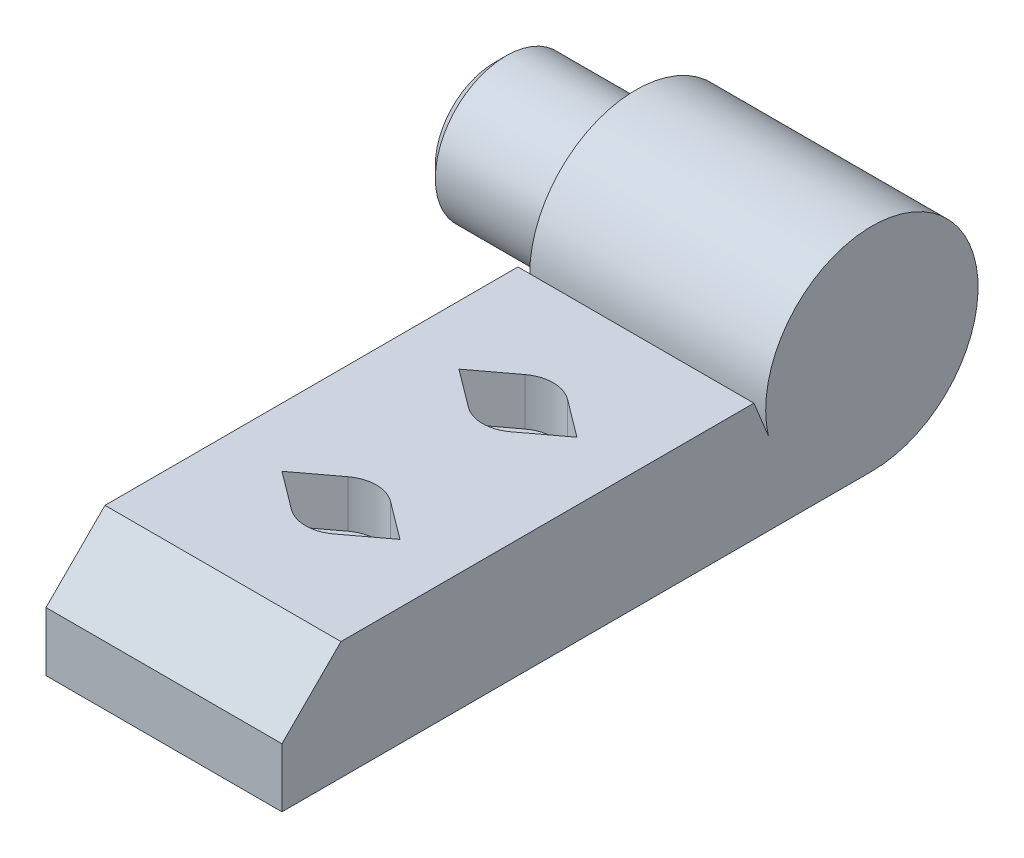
ISO-10303-21;
HEADER;
FILE_DESCRIPTION(('STEP AP214'),'2;1');
FILE_NAME('part.step','',(''),(''),'','','');
FILE_SCHEMA(('AUTOMOTIVE_DESIGN { 1 0 10303 214 1 1 1 1 }'));
ENDSEC;
DATA;
#1=APPLICATION_CONTEXT('core data for automotive mechanical design processes');
#2=APPLICATION_PROTOCOL_DEFINITION('international standard','automotive_design',2000,#1);
#3=PRODUCT_CONTEXT('',#1,'mechanical');
#4=PRODUCT('Part','Part','',(#3));
#5=PRODUCT_RELATED_PRODUCT_CATEGORY('part','',(#4));
#6=PRODUCT_DEFINITION_FORMATION('','',#4);
#7=PRODUCT_DEFINITION_CONTEXT('part definition',#1,'design');
#8=PRODUCT_DEFINITION('design','',#6,#7);
#9=PRODUCT_DEFINITION_SHAPE('','',#8);
#10=(LENGTH_UNIT() NAMED_UNIT(*) SI_UNIT(.MILLI.,.METRE.));
#11=(NAMED_UNIT(*) PLANE_ANGLE_UNIT() SI_UNIT($,.RADIAN.));
#12=(NAMED_UNIT(*) SI_UNIT($,.STERADIAN.) SOLID_ANGLE_UNIT());
#13=UNCERTAINTY_MEASURE_WITH_UNIT(LENGTH_MEASURE(1.E-05),#10,'distance_accuracy_value','');
#14=(GEOMETRIC_REPRESENTATION_CONTEXT(3) GLOBAL_UNCERTAINTY_ASSIGNED_CONTEXT((#13)) GLOBAL_UNIT_ASSIGNED_CONTEXT((#10,
#11,#12)) REPRESENTATION_CONTEXT('',''));
#15=CARTESIAN_POINT('',(0.,0.,0.));
#16=DIRECTION('',(0.,0.,1.));
#17=DIRECTION('',(1.,0.,0.));
#18=AXIS2_PLACEMENT_3D('',#15,#16,#17);
#19=CARTESIAN_POINT('',(-10.,6.,-30.));
#20=DIRECTION('',(0.,1.,0.));
#21=DIRECTION('',(0.,0.,1.));
#22=AXIS2_PLACEMENT_3D('',#19,#20,#21);
#23=CYLINDRICAL_SURFACE('',#22,3.);
#24=CARTESIAN_POINT('',(-10.,10.,-30.));
#25=DIRECTION('',(0.,1.,0.));
#26=DIRECTION('',(0.,0.,1.));
#27=AXIS2_PLACEMENT_3D('',#24,#25,#26);
#28=CIRCLE('',#27,3.);
#29=CARTESIAN_POINT('',(-8.2,10.,-32.4));
#30=VERTEX_POINT('',#29);
#31=CARTESIAN_POINT('',(-11.8,10.,-32.4));
#32=VERTEX_POINT('',#31);
#33=EDGE_CURVE('E272',#30,#32,#28,.T.);
#34=ORIENTED_EDGE('',*,*,#33,.T.);
#35=DIRECTION('',(0.,1.,0.));
#36=VECTOR('',#35,1.);
#37=CARTESIAN_POINT('',(-11.8,-5.66190378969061,-32.4));
#38=LINE('',#37,#36);
#39=CARTESIAN_POINT('',(-11.8,6.,-32.4));
#40=VERTEX_POINT('',#39);
#41=EDGE_CURVE('E182',#40,#32,#38,.T.);
#42=ORIENTED_EDGE('',*,*,#41,.F.);
#43=CARTESIAN_POINT('',(-10.,6.,-30.));
#44=DIRECTION('',(0.,1.,0.));
#45=DIRECTION('',(0.,0.,1.));
#46=AXIS2_PLACEMENT_3D('',#43,#44,#45);
#47=CIRCLE('',#46,3.);
#48=CARTESIAN_POINT('',(-8.2,6.,-32.4));
#49=VERTEX_POINT('',#48);
#50=EDGE_CURVE('E271',#49,#40,#47,.T.);
#51=ORIENTED_EDGE('',*,*,#50,.F.);
#52=DIRECTION('',(0.,1.,0.));
#53=VECTOR('',#52,1.);
#54=CARTESIAN_POINT('',(-8.2,-5.66190378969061,-32.4));
#55=LINE('',#54,#53);
#56=EDGE_CURVE('E65',#49,#30,#55,.T.);
#57=ORIENTED_EDGE('',*,*,#56,.T.);
#58=EDGE_LOOP('',(#34,#42,#51,#57));
#59=FACE_BOUND('',#58,.T.);
#60=ADVANCED_FACE('F41',(#59),#23,.F.);
#61=CARTESIAN_POINT('',(-10.,6.,-15.));
#62=DIRECTION('',(0.,1.,0.));
#63=DIRECTION('',(0.,0.,1.));
#64=AXIS2_PLACEMENT_3D('',#61,#62,#63);
#65=CYLINDRICAL_SURFACE('',#64,3.);
#66=CARTESIAN_POINT('',(-10.,10.,-15.));
#67=DIRECTION('',(0.,1.,0.));
#68=DIRECTION('',(0.,0.,1.));
#69=AXIS2_PLACEMENT_3D('',#66,#67,#68);
#70=CIRCLE('',#69,3.);
#71=CARTESIAN_POINT('',(-8.2,10.,-17.4));
#72=VERTEX_POINT('',#71);
#73=CARTESIAN_POINT('',(-11.8,10.,-17.4));
#74=VERTEX_POINT('',#73);
#75=EDGE_CURVE('E280',#72,#74,#70,.T.);
#76=ORIENTED_EDGE('',*,*,#75,.T.);
#77=DIRECTION('',(0.,1.,0.));
#78=VECTOR('',#77,1.);
#79=CARTESIAN_POINT('',(-11.8,-5.66190378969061,-17.4));
#80=LINE('',#79,#78);
#81=CARTESIAN_POINT('',(-11.8,6.,-17.4));
#82=VERTEX_POINT('',#81);
#83=EDGE_CURVE('E227',#82,#74,#80,.T.);
#84=ORIENTED_EDGE('',*,*,#83,.F.);
#85=CARTESIAN_POINT('',(-10.,6.,-15.));
#86=DIRECTION('',(0.,1.,0.));
#87=DIRECTION('',(0.,0.,1.));
#88=AXIS2_PLACEMENT_3D('',#85,#86,#87);
#89=CIRCLE('',#88,3.);
#90=CARTESIAN_POINT('',(-8.2,6.,-17.4));
#91=VERTEX_POINT('',#90);
#92=EDGE_CURVE('E275',#91,#82,#89,.T.);
#93=ORIENTED_EDGE('',*,*,#92,.F.);
#94=DIRECTION('',(0.,1.,0.));
#95=VECTOR('',#94,1.);
#96=CARTESIAN_POINT('',(-8.2,-5.66190378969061,-17.4));
#97=LINE('',#96,#95);
#98=EDGE_CURVE('E250',#91,#72,#97,.T.);
#99=ORIENTED_EDGE('',*,*,#98,.T.);
#100=EDGE_LOOP('',(#76,#84,#93,#99));
#101=FACE_BOUND('',#100,.T.);
#102=ADVANCED_FACE('F389',(#101),#65,.F.);
#103=CARTESIAN_POINT('',(-10.,-0.000999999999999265,-15.));
#104=DIRECTION('',(0.,1.,0.));
#105=DIRECTION('',(0.,0.,1.));
#106=AXIS2_PLACEMENT_3D('',#103,#104,#105);
#107=CYLINDRICAL_SURFACE('',#106,1.75);
#108=CARTESIAN_POINT('',(-10.,0.,-15.));
#109=DIRECTION('',(0.,-1.,0.));
#110=DIRECTION('',(0.,0.,-1.));
#111=AXIS2_PLACEMENT_3D('',#108,#109,#110);
#112=CIRCLE('',#111,1.75);
#113=CARTESIAN_POINT('',(-10.,0.,-16.75));
#114=VERTEX_POINT('',#113);
#115=EDGE_CURVE('E289',#114,#114,#112,.F.);
#116=ORIENTED_EDGE('',*,*,#115,.F.);
#117=EDGE_LOOP('',(#116));
#118=FACE_BOUND('',#117,.T.);
#119=CARTESIAN_POINT('',(-10.,6.,-15.));
#120=DIRECTION('',(0.,1.,0.));
#121=DIRECTION('',(0.,0.,1.));
#122=AXIS2_PLACEMENT_3D('',#119,#120,#121);
#123=CIRCLE('',#122,1.75);
#124=CARTESIAN_POINT('',(-10.,6.,-13.25));
#125=VERTEX_POINT('',#124);
#126=EDGE_CURVE('E293',#125,#125,#123,.F.);
#127=ORIENTED_EDGE('',*,*,#126,.F.);
#128=EDGE_LOOP('',(#127));
#129=FACE_BOUND('',#128,.T.);
#130=ADVANCED_FACE('F396',(#118,#129),#107,.F.);
#131=CARTESIAN_POINT('',(-10.,-0.000999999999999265,-30.));
#132=DIRECTION('',(0.,1.,0.));
#133=DIRECTION('',(0.,0.,1.));
#134=AXIS2_PLACEMENT_3D('',#131,#132,#133);
#135=CYLINDRICAL_SURFACE('',#134,1.75);
#136=CARTESIAN_POINT('',(-10.,0.,-30.));
#137=DIRECTION('',(0.,-1.,0.));
#138=DIRECTION('',(0.,0.,-1.));
#139=AXIS2_PLACEMENT_3D('',#136,#137,#138);
#140=CIRCLE('',#139,1.75);
#141=CARTESIAN_POINT('',(-10.,0.,-31.75));
#142=VERTEX_POINT('',#141);
#143=EDGE_CURVE('E284',#142,#142,#140,.F.);
#144=ORIENTED_EDGE('',*,*,#143,.F.);
#145=EDGE_LOOP('',(#144));
#146=FACE_BOUND('',#145,.T.);
#147=CARTESIAN_POINT('',(-10.,6.,-30.));
#148=DIRECTION('',(0.,1.,0.));
#149=DIRECTION('',(0.,0.,1.));
#150=AXIS2_PLACEMENT_3D('',#147,#148,#149);
#151=CIRCLE('',#150,1.75);
#152=CARTESIAN_POINT('',(-10.,6.,-28.25));
#153=VERTEX_POINT('',#152);
#154=EDGE_CURVE('E360',#153,#153,#151,.F.);
#155=ORIENTED_EDGE('',*,*,#154,.F.);
#156=EDGE_LOOP('',(#155));
#157=FACE_BOUND('',#156,.T.);
#158=ADVANCED_FACE('F520',(#146,#157),#135,.F.);
#159=CARTESIAN_POINT('',(-20.,5.,0.));
#160=DIRECTION('',(0.,0.,1.));
#161=DIRECTION('',(1.,0.,0.));
#162=AXIS2_PLACEMENT_3D('',#159,#160,#161);
#163=PLANE('',#162);
#164=DIRECTION('',(0.,-1.,0.));
#165=VECTOR('',#164,1.);
#166=CARTESIAN_POINT('',(0.,5.,0.));
#167=LINE('',#166,#165);
#168=CARTESIAN_POINT('',(0.,5.,0.));
#169=VERTEX_POINT('',#168);
#170=CARTESIAN_POINT('',(0.,0.,0.));
#171=VERTEX_POINT('',#170);
#172=EDGE_CURVE('E288',#169,#171,#167,.T.);
#173=ORIENTED_EDGE('',*,*,#172,.F.);
#174=DIRECTION('',(1.,0.,0.));
#175=VECTOR('',#174,1.);
#176=CARTESIAN_POINT('',(-20.,5.,0.));
#177=LINE('',#176,#175);
#178=CARTESIAN_POINT('',(-20.,5.,0.));
#179=VERTEX_POINT('',#178);
#180=EDGE_CURVE('E342',#179,#169,#177,.T.);
#181=ORIENTED_EDGE('',*,*,#180,.F.);
#182=DIRECTION('',(0.,-1.,0.));
#183=VECTOR('',#182,1.);
#184=CARTESIAN_POINT('',(-20.,5.,0.));
#185=LINE('',#184,#183);
#186=CARTESIAN_POINT('',(-20.,0.,0.));
#187=VERTEX_POINT('',#186);
#188=EDGE_CURVE('E294',#179,#187,#185,.T.);
#189=ORIENTED_EDGE('',*,*,#188,.T.);
#190=DIRECTION('',(1.,0.,0.));
#191=VECTOR('',#190,1.);
#192=CARTESIAN_POINT('',(-20.,0.,0.));
#193=LINE('',#192,#191);
#194=EDGE_CURVE('E319',#187,#171,#193,.T.);
#195=ORIENTED_EDGE('',*,*,#194,.T.);
#196=EDGE_LOOP('',(#173,#181,#189,#195));
#197=FACE_BOUND('',#196,.T.);
#198=ADVANCED_FACE('F501',(#197),#163,.T.);
#199=CARTESIAN_POINT('',(-20.,5.,0.));
#200=DIRECTION('',(0.,0.707106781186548,0.707106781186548));
#201=DIRECTION('',(0.,-0.707106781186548,0.707106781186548));
#202=AXIS2_PLACEMENT_3D('',#199,#200,#201);
#203=PLANE('',#202);
#204=DIRECTION('',(0.,-0.707106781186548,0.707106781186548));
#205=VECTOR('',#204,1.);
#206=CARTESIAN_POINT('',(0.,5.,0.));
#207=LINE('',#206,#205);
#208=CARTESIAN_POINT('',(0.,10.,-5.));
#209=VERTEX_POINT('',#208);
#210=EDGE_CURVE('E299',#209,#169,#207,.T.);
#211=ORIENTED_EDGE('',*,*,#210,.F.);
#212=DIRECTION('',(1.,0.,0.));
#213=VECTOR('',#212,1.);
#214=CARTESIAN_POINT('',(-20.,10.,-5.));
#215=LINE('',#214,#213);
#216=CARTESIAN_POINT('',(-20.,10.,-5.));
#217=VERTEX_POINT('',#216);
#218=EDGE_CURVE('E346',#217,#209,#215,.T.);
#219=ORIENTED_EDGE('',*,*,#218,.F.);
#220=DIRECTION('',(0.,-0.707106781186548,0.707106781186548));
#221=VECTOR('',#220,1.);
#222=CARTESIAN_POINT('',(-20.,5.,0.));
#223=LINE('',#222,#221);
#224=EDGE_CURVE('E315',#217,#179,#223,.T.);
#225=ORIENTED_EDGE('',*,*,#224,.T.);
#226=ORIENTED_EDGE('',*,*,#180,.T.);
#227=EDGE_LOOP('',(#211,#219,#225,#226));
#228=FACE_BOUND('',#227,.T.);
#229=ADVANCED_FACE('F489',(#228),#203,.T.);
#230=CARTESIAN_POINT('',(-20.,10.,-40.));
#231=DIRECTION('',(0.,1.,0.));
#232=DIRECTION('',(0.,0.,1.));
#233=AXIS2_PLACEMENT_3D('',#230,#231,#232);
#234=PLANE('',#233);
#235=DIRECTION('',(-0.8,0.,-0.6));
#236=VECTOR('',#235,1.);
#237=CARTESIAN_POINT('',(-5.,10.,-30.));
#238=LINE('',#237,#236);
#239=CARTESIAN_POINT('',(-5.,10.,-30.));
#240=VERTEX_POINT('',#239);
#241=EDGE_CURVE('E176',#240,#30,#238,.T.);
#242=ORIENTED_EDGE('',*,*,#241,.F.);
#243=DIRECTION('',(0.8,0.,-0.6));
#244=VECTOR('',#243,1.);
#245=CARTESIAN_POINT('',(-5.,10.,-30.));
#246=LINE('',#245,#244);
#247=CARTESIAN_POINT('',(-8.2,10.,-27.6));
#248=VERTEX_POINT('',#247);
#249=EDGE_CURVE('E197',#248,#240,#246,.T.);
#250=ORIENTED_EDGE('',*,*,#249,.F.);
#251=CARTESIAN_POINT('',(-11.8,10.,-27.6));
#252=VERTEX_POINT('',#251);
#253=EDGE_CURVE('E195',#252,#248,#28,.T.);
#254=ORIENTED_EDGE('',*,*,#253,.F.);
#255=DIRECTION('',(0.8,0.,0.6));
#256=VECTOR('',#255,1.);
#257=CARTESIAN_POINT('',(-15.,10.,-30.));
#258=LINE('',#257,#256);
#259=CARTESIAN_POINT('',(-15.,10.,-30.));
#260=VERTEX_POINT('',#259);
#261=EDGE_CURVE('E171',#260,#252,#258,.T.);
#262=ORIENTED_EDGE('',*,*,#261,.F.);
#263=DIRECTION('',(-0.8,0.,0.6));
#264=VECTOR('',#263,1.);
#265=CARTESIAN_POINT('',(-15.,10.,-30.));
#266=LINE('',#265,#264);
#267=EDGE_CURVE('E179',#32,#260,#266,.T.);
#268=ORIENTED_EDGE('',*,*,#267,.F.);
#269=ORIENTED_EDGE('',*,*,#33,.F.);
#270=EDGE_LOOP('',(#242,#250,#254,#262,#268,#269));
#271=FACE_BOUND('',#270,.T.);
#272=DIRECTION('',(-0.8,0.,-0.6));
#273=VECTOR('',#272,1.);
#274=CARTESIAN_POINT('',(-5.,10.,-15.));
#275=LINE('',#274,#273);
#276=CARTESIAN_POINT('',(-5.,10.,-15.));
#277=VERTEX_POINT('',#276);
#278=EDGE_CURVE('E244',#277,#72,#275,.T.);
#279=ORIENTED_EDGE('',*,*,#278,.F.);
#280=DIRECTION('',(0.8,0.,-0.6));
#281=VECTOR('',#280,1.);
#282=CARTESIAN_POINT('',(-5.,10.,-15.));
#283=LINE('',#282,#281);
#284=CARTESIAN_POINT('',(-8.2,10.,-12.6));
#285=VERTEX_POINT('',#284);
#286=EDGE_CURVE('E240',#285,#277,#283,.T.);
#287=ORIENTED_EDGE('',*,*,#286,.F.);
#288=CARTESIAN_POINT('',(-11.8,10.,-12.6));
#289=VERTEX_POINT('',#288);
#290=EDGE_CURVE('E221',#289,#285,#70,.T.);
#291=ORIENTED_EDGE('',*,*,#290,.F.);
#292=DIRECTION('',(0.8,0.,0.6));
#293=VECTOR('',#292,1.);
#294=CARTESIAN_POINT('',(-15.,10.,-15.));
#295=LINE('',#294,#293);
#296=CARTESIAN_POINT('',(-15.,10.,-15.));
#297=VERTEX_POINT('',#296);
#298=EDGE_CURVE('E237',#297,#289,#295,.T.);
#299=ORIENTED_EDGE('',*,*,#298,.F.);
#300=DIRECTION('',(-0.8,0.,0.6));
#301=VECTOR('',#300,1.);
#302=CARTESIAN_POINT('',(-15.,10.,-15.));
#303=LINE('',#302,#301);
#304=EDGE_CURVE('E233',#74,#297,#303,.T.);
#305=ORIENTED_EDGE('',*,*,#304,.F.);
#306=ORIENTED_EDGE('',*,*,#75,.F.);
#307=EDGE_LOOP('',(#279,#287,#291,#299,#305,#306));
#308=FACE_BOUND('',#307,.T.);
#309=DIRECTION('',(0.,0.,1.));
#310=VECTOR('',#309,1.);
#311=CARTESIAN_POINT('',(0.,10.,-40.));
#312=LINE('',#311,#310);
#313=CARTESIAN_POINT('',(0.,10.,-40.));
#314=VERTEX_POINT('',#313);
#315=EDGE_CURVE('E335',#314,#209,#312,.T.);
#316=ORIENTED_EDGE('',*,*,#315,.F.);
#317=DIRECTION('',(1.,0.,0.));
#318=VECTOR('',#317,1.);
#319=CARTESIAN_POINT('',(-20.,10.,-40.));
#320=LINE('',#319,#318);
#321=CARTESIAN_POINT('',(-20.,10.,-40.));
#322=VERTEX_POINT('',#321);
#323=EDGE_CURVE('E349',#322,#314,#320,.T.);
#324=ORIENTED_EDGE('',*,*,#323,.F.);
#325=DIRECTION('',(0.,0.,1.));
#326=VECTOR('',#325,1.);
#327=CARTESIAN_POINT('',(-20.,10.,-40.));
#328=LINE('',#327,#326);
#329=EDGE_CURVE('E311',#322,#217,#328,.T.);
#330=ORIENTED_EDGE('',*,*,#329,.T.);
#331=ORIENTED_EDGE('',*,*,#218,.T.);
#332=EDGE_LOOP('',(#316,#324,#330,#331));
#333=FACE_BOUND('',#332,.T.);
#334=ADVANCED_FACE('F191',(#271,#308,#333),#234,.T.);
#335=CARTESIAN_POINT('',(-20.,10.,-40.));
#336=DIRECTION('',(0.,0.378041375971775,-0.925788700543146));
#337=DIRECTION('',(0.,0.925788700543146,0.378041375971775));
#338=AXIS2_PLACEMENT_3D('',#335,#336,#337);
#339=PLANE('',#338);
#340=DIRECTION('',(0.,0.925788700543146,0.378041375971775));
#341=VECTOR('',#340,1.);
#342=CARTESIAN_POINT('',(0.,10.,-40.));
#343=LINE('',#342,#341);
#344=CARTESIAN_POINT('',(0.,7.00000000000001,-41.2250356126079));
#345=VERTEX_POINT('',#344);
#346=EDGE_CURVE('E331',#345,#314,#343,.T.);
#347=ORIENTED_EDGE('',*,*,#346,.F.);
#348=DIRECTION('',(1.,0.,0.));
#349=VECTOR('',#348,1.);
#350=CARTESIAN_POINT('',(-20.,7.00000000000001,-41.2250356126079));
#351=LINE('',#350,#349);
#352=CARTESIAN_POINT('',(-20.,7.00000000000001,-41.2250356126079));
#353=VERTEX_POINT('',#352);
#354=EDGE_CURVE('E352',#353,#345,#351,.T.);
#355=ORIENTED_EDGE('',*,*,#354,.F.);
#356=DIRECTION('',(0.,0.925788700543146,0.378041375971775));
#357=VECTOR('',#356,1.);
#358=CARTESIAN_POINT('',(-20.,10.,-40.));
#359=LINE('',#358,#357);
#360=EDGE_CURVE('E307',#353,#322,#359,.T.);
#361=ORIENTED_EDGE('',*,*,#360,.T.);
#362=ORIENTED_EDGE('',*,*,#323,.T.);
#363=EDGE_LOOP('',(#347,#355,#361,#362));
#364=FACE_BOUND('',#363,.T.);
#365=ADVANCED_FACE('F495',(#364),#339,.T.);
#366=CARTESIAN_POINT('',(-20.,9.,-50.));
#367=DIRECTION('',(1.,0.,0.));
#368=DIRECTION('',(0.,0.,-1.));
#369=AXIS2_PLACEMENT_3D('',#366,#367,#368);
#370=CYLINDRICAL_SURFACE('',#369,9.);
#371=CARTESIAN_POINT('',(0.,9.,-50.));
#372=DIRECTION('',(1.,0.,0.));
#373=DIRECTION('',(0.,0.,-1.));
#374=AXIS2_PLACEMENT_3D('',#371,#372,#373);
#375=CIRCLE('',#374,9.);
#376=CARTESIAN_POINT('',(0.,0.,-50.));
#377=VERTEX_POINT('',#376);
#378=EDGE_CURVE('E327',#377,#345,#375,.T.);
#379=ORIENTED_EDGE('',*,*,#378,.F.);
#380=DIRECTION('',(1.,0.,0.));
#381=VECTOR('',#380,1.);
#382=CARTESIAN_POINT('',(-20.,0.,-50.));
#383=LINE('',#382,#381);
#384=CARTESIAN_POINT('',(-20.,0.,-50.));
#385=VERTEX_POINT('',#384);
#386=EDGE_CURVE('E355',#385,#377,#383,.T.);
#387=ORIENTED_EDGE('',*,*,#386,.F.);
#388=CARTESIAN_POINT('',(-20.,9.,-50.));
#389=DIRECTION('',(1.,0.,0.));
#390=DIRECTION('',(0.,0.,-1.));
#391=AXIS2_PLACEMENT_3D('',#388,#389,#390);
#392=CIRCLE('',#391,9.);
#393=EDGE_CURVE('E303',#385,#353,#392,.T.);
#394=ORIENTED_EDGE('',*,*,#393,.T.);
#395=ORIENTED_EDGE('',*,*,#354,.T.);
#396=EDGE_LOOP('',(#379,#387,#394,#395));
#397=FACE_BOUND('',#396,.T.);
#398=ADVANCED_FACE('F498',(#397),#370,.T.);
#399=CARTESIAN_POINT('',(-20.,0.,0.));
#400=DIRECTION('',(0.,-1.,0.));
#401=DIRECTION('',(0.,0.,-1.));
#402=AXIS2_PLACEMENT_3D('',#399,#400,#401);
#403=PLANE('',#402);
#404=ORIENTED_EDGE('',*,*,#143,.T.);
#405=EDGE_LOOP('',(#404));
#406=FACE_BOUND('',#405,.T.);
#407=ORIENTED_EDGE('',*,*,#115,.T.);
#408=EDGE_LOOP('',(#407));
#409=FACE_BOUND('',#408,.T.);
#410=DIRECTION('',(0.,0.,-1.));
#411=VECTOR('',#410,1.);
#412=CARTESIAN_POINT('',(0.,0.,0.));
#413=LINE('',#412,#411);
#414=EDGE_CURVE('E323',#171,#377,#413,.T.);
#415=ORIENTED_EDGE('',*,*,#414,.F.);
#416=ORIENTED_EDGE('',*,*,#194,.F.);
#417=DIRECTION('',(0.,0.,-1.));
#418=VECTOR('',#417,1.);
#419=CARTESIAN_POINT('',(-20.,0.,0.));
#420=LINE('',#419,#418);
#421=EDGE_CURVE('E298',#187,#385,#420,.T.);
#422=ORIENTED_EDGE('',*,*,#421,.T.);
#423=ORIENTED_EDGE('',*,*,#386,.T.);
#424=EDGE_LOOP('',(#415,#416,#422,#423));
#425=FACE_BOUND('',#424,.T.);
#426=ADVANCED_FACE('F479',(#406,#409,#425),#403,.T.);
#427=CARTESIAN_POINT('',(-20.,9.,-50.));
#428=DIRECTION('',(1.,0.,0.));
#429=DIRECTION('',(0.,0.,-1.));
#430=AXIS2_PLACEMENT_3D('',#427,#428,#429);
#431=PLANE('',#430);
#432=CARTESIAN_POINT('',(-20.,9.,-50.));
#433=DIRECTION('',(1.,0.,0.));
#434=DIRECTION('',(0.,0.,-1.));
#435=AXIS2_PLACEMENT_3D('',#432,#433,#434);
#436=CIRCLE('',#435,6.);
#437=CARTESIAN_POINT('',(-20.,9.,-56.));
#438=VERTEX_POINT('',#437);
#439=EDGE_CURVE('E345',#438,#438,#436,.F.);
#440=ORIENTED_EDGE('',*,*,#439,.F.);
#441=EDGE_LOOP('',(#440));
#442=FACE_BOUND('',#441,.T.);
#443=ORIENTED_EDGE('',*,*,#188,.F.);
#444=ORIENTED_EDGE('',*,*,#224,.F.);
#445=ORIENTED_EDGE('',*,*,#329,.F.);
#446=ORIENTED_EDGE('',*,*,#360,.F.);
#447=ORIENTED_EDGE('',*,*,#393,.F.);
#448=ORIENTED_EDGE('',*,*,#421,.F.);
#449=EDGE_LOOP('',(#443,#444,#445,#446,#447,#448));
#450=FACE_BOUND('',#449,.T.);
#451=ADVANCED_FACE('F476',(#442,#450),#431,.F.);
#452=CARTESIAN_POINT('',(0.,9.,-50.));
#453=DIRECTION('',(1.,0.,0.));
#454=DIRECTION('',(0.,0.,-1.));
#455=AXIS2_PLACEMENT_3D('',#452,#453,#454);
#456=PLANE('',#455);
#457=ORIENTED_EDGE('',*,*,#172,.T.);
#458=ORIENTED_EDGE('',*,*,#414,.T.);
#459=ORIENTED_EDGE('',*,*,#378,.T.);
#460=ORIENTED_EDGE('',*,*,#346,.T.);
#461=ORIENTED_EDGE('',*,*,#315,.T.);
#462=ORIENTED_EDGE('',*,*,#210,.T.);
#463=EDGE_LOOP('',(#457,#458,#459,#460,#461,#462));
#464=FACE_BOUND('',#463,.T.);
#465=ADVANCED_FACE('F411',(#464),#456,.T.);
#466=CARTESIAN_POINT('',(-10.,6.,-30.));
#467=DIRECTION('',(0.,1.,0.));
#468=DIRECTION('',(0.,0.,1.));
#469=AXIS2_PLACEMENT_3D('',#466,#467,#468);
#470=PLANE('',#469);
#471=CARTESIAN_POINT('',(-11.8,6.,-27.6));
#472=VERTEX_POINT('',#471);
#473=CARTESIAN_POINT('',(-8.2,6.,-27.6));
#474=VERTEX_POINT('',#473);
#475=EDGE_CURVE('E268',#472,#474,#47,.T.);
#476=ORIENTED_EDGE('',*,*,#475,.T.);
#477=DIRECTION('',(-0.8,0.,0.6));
#478=VECTOR('',#477,1.);
#479=CARTESIAN_POINT('',(-5.,6.,-30.));
#480=LINE('',#479,#478);
#481=CARTESIAN_POINT('',(-5.,6.,-30.));
#482=VERTEX_POINT('',#481);
#483=EDGE_CURVE('E208',#482,#474,#480,.T.);
#484=ORIENTED_EDGE('',*,*,#483,.F.);
#485=DIRECTION('',(0.8,0.,0.6));
#486=VECTOR('',#485,1.);
#487=CARTESIAN_POINT('',(-5.,6.,-30.));
#488=LINE('',#487,#486);
#489=EDGE_CURVE('E418',#49,#482,#488,.T.);
#490=ORIENTED_EDGE('',*,*,#489,.F.);
#491=ORIENTED_EDGE('',*,*,#50,.T.);
#492=DIRECTION('',(0.8,0.,-0.6));
#493=VECTOR('',#492,1.);
#494=CARTESIAN_POINT('',(-15.,6.,-30.));
#495=LINE('',#494,#493);
#496=CARTESIAN_POINT('',(-15.,6.,-30.));
#497=VERTEX_POINT('',#496);
#498=EDGE_CURVE('E222',#497,#40,#495,.T.);
#499=ORIENTED_EDGE('',*,*,#498,.F.);
#500=DIRECTION('',(-0.8,0.,-0.6));
#501=VECTOR('',#500,1.);
#502=CARTESIAN_POINT('',(-15.,6.,-30.));
#503=LINE('',#502,#501);
#504=EDGE_CURVE('E57',#472,#497,#503,.T.);
#505=ORIENTED_EDGE('',*,*,#504,.F.);
#506=EDGE_LOOP('',(#476,#484,#490,#491,#499,#505));
#507=FACE_BOUND('',#506,.T.);
#508=ORIENTED_EDGE('',*,*,#154,.T.);
#509=EDGE_LOOP('',(#508));
#510=FACE_BOUND('',#509,.T.);
#511=ADVANCED_FACE('F404',(#507,#510),#470,.T.);
#512=ORIENTED_EDGE('',*,*,#253,.T.);
#513=DIRECTION('',(0.,1.,0.));
#514=VECTOR('',#513,1.);
#515=CARTESIAN_POINT('',(-8.2,-5.66190378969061,-27.6));
#516=LINE('',#515,#514);
#517=EDGE_CURVE('E214',#474,#248,#516,.T.);
#518=ORIENTED_EDGE('',*,*,#517,.F.);
#519=ORIENTED_EDGE('',*,*,#475,.F.);
#520=DIRECTION('',(0.,1.,0.));
#521=VECTOR('',#520,1.);
#522=CARTESIAN_POINT('',(-11.8,-5.66190378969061,-27.6));
#523=LINE('',#522,#521);
#524=EDGE_CURVE('E175',#472,#252,#523,.T.);
#525=ORIENTED_EDGE('',*,*,#524,.T.);
#526=EDGE_LOOP('',(#512,#518,#519,#525));
#527=FACE_BOUND('',#526,.T.);
#528=ADVANCED_FACE('F392',(#527),#23,.F.);
#529=CARTESIAN_POINT('',(-10.,6.,-15.));
#530=DIRECTION('',(0.,1.,0.));
#531=DIRECTION('',(0.,0.,1.));
#532=AXIS2_PLACEMENT_3D('',#529,#530,#531);
#533=PLANE('',#532);
#534=CARTESIAN_POINT('',(-11.8,6.,-12.6));
#535=VERTEX_POINT('',#534);
#536=CARTESIAN_POINT('',(-8.2,6.,-12.6));
#537=VERTEX_POINT('',#536);
#538=EDGE_CURVE('E276',#535,#537,#89,.T.);
#539=ORIENTED_EDGE('',*,*,#538,.T.);
#540=DIRECTION('',(-0.8,0.,0.6));
#541=VECTOR('',#540,1.);
#542=CARTESIAN_POINT('',(-5.,6.,-15.));
#543=LINE('',#542,#541);
#544=CARTESIAN_POINT('',(-5.,6.,-15.));
#545=VERTEX_POINT('',#544);
#546=EDGE_CURVE('E223',#545,#537,#543,.T.);
#547=ORIENTED_EDGE('',*,*,#546,.F.);
#548=DIRECTION('',(0.8,0.,0.6));
#549=VECTOR('',#548,1.);
#550=CARTESIAN_POINT('',(-5.,6.,-15.));
#551=LINE('',#550,#549);
#552=EDGE_CURVE('E226',#91,#545,#551,.T.);
#553=ORIENTED_EDGE('',*,*,#552,.F.);
#554=ORIENTED_EDGE('',*,*,#92,.T.);
#555=DIRECTION('',(0.8,0.,-0.6));
#556=VECTOR('',#555,1.);
#557=CARTESIAN_POINT('',(-15.,6.,-15.));
#558=LINE('',#557,#556);
#559=CARTESIAN_POINT('',(-15.,6.,-15.));
#560=VERTEX_POINT('',#559);
#561=EDGE_CURVE('E230',#560,#82,#558,.T.);
#562=ORIENTED_EDGE('',*,*,#561,.F.);
#563=DIRECTION('',(-0.8,0.,-0.6));
#564=VECTOR('',#563,1.);
#565=CARTESIAN_POINT('',(-15.,6.,-15.));
#566=LINE('',#565,#564);
#567=EDGE_CURVE('E187',#535,#560,#566,.T.);
#568=ORIENTED_EDGE('',*,*,#567,.F.);
#569=EDGE_LOOP('',(#539,#547,#553,#554,#562,#568));
#570=FACE_BOUND('',#569,.T.);
#571=ORIENTED_EDGE('',*,*,#126,.T.);
#572=EDGE_LOOP('',(#571));
#573=FACE_BOUND('',#572,.T.);
#574=ADVANCED_FACE('F403',(#570,#573),#533,.T.);
#575=ORIENTED_EDGE('',*,*,#290,.T.);
#576=DIRECTION('',(0.,1.,0.));
#577=VECTOR('',#576,1.);
#578=CARTESIAN_POINT('',(-8.2,-5.66190378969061,-12.6));
#579=LINE('',#578,#577);
#580=EDGE_CURVE('E257',#537,#285,#579,.T.);
#581=ORIENTED_EDGE('',*,*,#580,.F.);
#582=ORIENTED_EDGE('',*,*,#538,.F.);
#583=DIRECTION('',(0.,1.,0.));
#584=VECTOR('',#583,1.);
#585=CARTESIAN_POINT('',(-11.8,-5.66190378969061,-12.6));
#586=LINE('',#585,#584);
#587=EDGE_CURVE('E260',#535,#289,#586,.T.);
#588=ORIENTED_EDGE('',*,*,#587,.T.);
#589=EDGE_LOOP('',(#575,#581,#582,#588));
#590=FACE_BOUND('',#589,.T.);
#591=ADVANCED_FACE('F399',(#590),#65,.F.);
#592=CARTESIAN_POINT('',(-32.,9.,-50.));
#593=DIRECTION('',(1.,0.,0.));
#594=DIRECTION('',(0.,0.,-1.));
#595=AXIS2_PLACEMENT_3D('',#592,#593,#594);
#596=CYLINDRICAL_SURFACE('',#595,6.);
#597=CARTESIAN_POINT('',(-31.,9.,-50.));
#598=DIRECTION('',(-1.,0.,0.));
#599=DIRECTION('',(0.,0.,1.));
#600=AXIS2_PLACEMENT_3D('',#597,#598,#599);
#601=CIRCLE('',#600,6.);
#602=CARTESIAN_POINT('',(-31.,9.,-44.));
#603=VERTEX_POINT('',#602);
#604=EDGE_CURVE('E11',#603,#603,#601,.F.);
#605=ORIENTED_EDGE('',*,*,#604,.T.);
#606=EDGE_LOOP('',(#605));
#607=FACE_BOUND('',#606,.T.);
#608=ORIENTED_EDGE('',*,*,#439,.T.);
#609=EDGE_LOOP('',(#608));
#610=FACE_BOUND('',#609,.T.);
#611=ADVANCED_FACE('F385',(#607,#610),#596,.T.);
#612=CARTESIAN_POINT('',(-32.,9.,-50.));
#613=DIRECTION('',(-1.,0.,0.));
#614=DIRECTION('',(0.,0.,1.));
#615=AXIS2_PLACEMENT_3D('',#612,#613,#614);
#616=PLANE('',#615);
#617=CARTESIAN_POINT('',(-32.,9.,-50.));
#618=DIRECTION('',(-1.,0.,0.));
#619=DIRECTION('',(0.,0.,1.));
#620=AXIS2_PLACEMENT_3D('',#617,#618,#619);
#621=CIRCLE('',#620,5.);
#622=CARTESIAN_POINT('',(-32.,9.,-45.));
#623=VERTEX_POINT('',#622);
#624=EDGE_CURVE('E50',#623,#623,#621,.T.);
#625=ORIENTED_EDGE('',*,*,#624,.T.);
#626=EDGE_LOOP('',(#625));
#627=FACE_BOUND('',#626,.T.);
#628=ADVANCED_FACE('F373',(#627),#616,.T.);
#629=CARTESIAN_POINT('',(-32.,9.,-50.));
#630=DIRECTION('',(1.,0.,0.));
#631=DIRECTION('',(0.,0.,-1.));
#632=AXIS2_PLACEMENT_3D('',#629,#630,#631);
#633=CONICAL_SURFACE('',#632,5.,0.785398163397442);
#634=ORIENTED_EDGE('',*,*,#604,.F.);
#635=EDGE_LOOP('',(#634));
#636=FACE_BOUND('',#635,.T.);
#637=ORIENTED_EDGE('',*,*,#624,.F.);
#638=EDGE_LOOP('',(#637));
#639=FACE_BOUND('',#638,.T.);
#640=ADVANCED_FACE('F43',(#636,#639),#633,.T.);
#641=CARTESIAN_POINT('',(-5.,-5.66190378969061,-15.));
#642=DIRECTION('',(0.6,0.,0.8));
#643=DIRECTION('',(0.8,0.,-0.6));
#644=AXIS2_PLACEMENT_3D('',#641,#642,#643);
#645=PLANE('',#644);
#646=ORIENTED_EDGE('',*,*,#546,.T.);
#647=ORIENTED_EDGE('',*,*,#580,.T.);
#648=ORIENTED_EDGE('',*,*,#286,.T.);
#649=DIRECTION('',(0.,1.,0.));
#650=VECTOR('',#649,1.);
#651=CARTESIAN_POINT('',(-5.,-5.66190378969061,-15.));
#652=LINE('',#651,#650);
#653=EDGE_CURVE('E254',#545,#277,#652,.T.);
#654=ORIENTED_EDGE('',*,*,#653,.F.);
#655=EDGE_LOOP('',(#646,#647,#648,#654));
#656=FACE_BOUND('',#655,.T.);
#657=ADVANCED_FACE('F376',(#656),#645,.F.);
#658=CARTESIAN_POINT('',(-5.,-5.66190378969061,-15.));
#659=DIRECTION('',(0.6,0.,-0.8));
#660=DIRECTION('',(-0.8,0.,-0.6));
#661=AXIS2_PLACEMENT_3D('',#658,#659,#660);
#662=PLANE('',#661);
#663=ORIENTED_EDGE('',*,*,#552,.T.);
#664=ORIENTED_EDGE('',*,*,#653,.T.);
#665=ORIENTED_EDGE('',*,*,#278,.T.);
#666=ORIENTED_EDGE('',*,*,#98,.F.);
#667=EDGE_LOOP('',(#663,#664,#665,#666));
#668=FACE_BOUND('',#667,.T.);
#669=ADVANCED_FACE('F382',(#668),#662,.F.);
#670=CARTESIAN_POINT('',(-15.,-5.66190378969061,-15.));
#671=DIRECTION('',(-0.6,0.,-0.8));
#672=DIRECTION('',(-0.8,0.,0.6));
#673=AXIS2_PLACEMENT_3D('',#670,#671,#672);
#674=PLANE('',#673);
#675=ORIENTED_EDGE('',*,*,#561,.T.);
#676=ORIENTED_EDGE('',*,*,#83,.T.);
#677=ORIENTED_EDGE('',*,*,#304,.T.);
#678=DIRECTION('',(0.,1.,0.));
#679=VECTOR('',#678,1.);
#680=CARTESIAN_POINT('',(-15.,-5.66190378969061,-15.));
#681=LINE('',#680,#679);
#682=EDGE_CURVE('E247',#560,#297,#681,.T.);
#683=ORIENTED_EDGE('',*,*,#682,.F.);
#684=EDGE_LOOP('',(#675,#676,#677,#683));
#685=FACE_BOUND('',#684,.T.);
#686=ADVANCED_FACE('F445',(#685),#674,.F.);
#687=CARTESIAN_POINT('',(-15.,-5.66190378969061,-15.));
#688=DIRECTION('',(-0.6,0.,0.8));
#689=DIRECTION('',(0.8,0.,0.6));
#690=AXIS2_PLACEMENT_3D('',#687,#688,#689);
#691=PLANE('',#690);
#692=ORIENTED_EDGE('',*,*,#567,.T.);
#693=ORIENTED_EDGE('',*,*,#682,.T.);
#694=ORIENTED_EDGE('',*,*,#298,.T.);
#695=ORIENTED_EDGE('',*,*,#587,.F.);
#696=EDGE_LOOP('',(#692,#693,#694,#695));
#697=FACE_BOUND('',#696,.T.);
#698=ADVANCED_FACE('F457',(#697),#691,.F.);
#699=CARTESIAN_POINT('',(-5.,-5.66190378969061,-30.));
#700=DIRECTION('',(0.6,0.,0.8));
#701=DIRECTION('',(0.8,0.,-0.6));
#702=AXIS2_PLACEMENT_3D('',#699,#700,#701);
#703=PLANE('',#702);
#704=ORIENTED_EDGE('',*,*,#483,.T.);
#705=ORIENTED_EDGE('',*,*,#517,.T.);
#706=ORIENTED_EDGE('',*,*,#249,.T.);
#707=DIRECTION('',(0.,1.,0.));
#708=VECTOR('',#707,1.);
#709=CARTESIAN_POINT('',(-5.,-5.66190378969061,-30.));
#710=LINE('',#709,#708);
#711=EDGE_CURVE('E211',#482,#240,#710,.T.);
#712=ORIENTED_EDGE('',*,*,#711,.F.);
#713=EDGE_LOOP('',(#704,#705,#706,#712));
#714=FACE_BOUND('',#713,.T.);
#715=ADVANCED_FACE('F423',(#714),#703,.F.);
#716=CARTESIAN_POINT('',(-5.,-5.66190378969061,-30.));
#717=DIRECTION('',(0.6,0.,-0.8));
#718=DIRECTION('',(-0.8,0.,-0.6));
#719=AXIS2_PLACEMENT_3D('',#716,#717,#718);
#720=PLANE('',#719);
#721=ORIENTED_EDGE('',*,*,#489,.T.);
#722=ORIENTED_EDGE('',*,*,#711,.T.);
#723=ORIENTED_EDGE('',*,*,#241,.T.);
#724=ORIENTED_EDGE('',*,*,#56,.F.);
#725=EDGE_LOOP('',(#721,#722,#723,#724));
#726=FACE_BOUND('',#725,.T.);
#727=ADVANCED_FACE('F424',(#726),#720,.F.);
#728=CARTESIAN_POINT('',(-15.,-5.66190378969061,-30.));
#729=DIRECTION('',(-0.6,0.,-0.8));
#730=DIRECTION('',(-0.8,0.,0.6));
#731=AXIS2_PLACEMENT_3D('',#728,#729,#730);
#732=PLANE('',#731);
#733=ORIENTED_EDGE('',*,*,#498,.T.);
#734=ORIENTED_EDGE('',*,*,#41,.T.);
#735=ORIENTED_EDGE('',*,*,#267,.T.);
#736=DIRECTION('',(0.,1.,0.));
#737=VECTOR('',#736,1.);
#738=CARTESIAN_POINT('',(-15.,-5.66190378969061,-30.));
#739=LINE('',#738,#737);
#740=EDGE_CURVE('E167',#497,#260,#739,.T.);
#741=ORIENTED_EDGE('',*,*,#740,.F.);
#742=EDGE_LOOP('',(#733,#734,#735,#741));
#743=FACE_BOUND('',#742,.T.);
#744=ADVANCED_FACE('F180',(#743),#732,.F.);
#745=CARTESIAN_POINT('',(-15.,-5.66190378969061,-30.));
#746=DIRECTION('',(-0.6,0.,0.8));
#747=DIRECTION('',(0.8,0.,0.6));
#748=AXIS2_PLACEMENT_3D('',#745,#746,#747);
#749=PLANE('',#748);
#750=ORIENTED_EDGE('',*,*,#504,.T.);
#751=ORIENTED_EDGE('',*,*,#740,.T.);
#752=ORIENTED_EDGE('',*,*,#261,.T.);
#753=ORIENTED_EDGE('',*,*,#524,.F.);
#754=EDGE_LOOP('',(#750,#751,#752,#753));
#755=FACE_BOUND('',#754,.T.);
#756=ADVANCED_FACE('F169',(#755),#749,.F.);
#757=CLOSED_SHELL('',(#60,#102,#130,#158,#198,#229,#334,#365,#398,#426,#451,#465,#511,#528,#574,
#591,#611,#628,#640,#657,#669,#686,#698,#715,#727,#744,#756));
#758=MANIFOLD_SOLID_BREP('B2',#757);
#759=ADVANCED_BREP_SHAPE_REPRESENTATION('',(#18,#758),#14);
#760=SHAPE_DEFINITION_REPRESENTATION(#9,#759);
ENDSEC;
END-ISO-10303-21;
